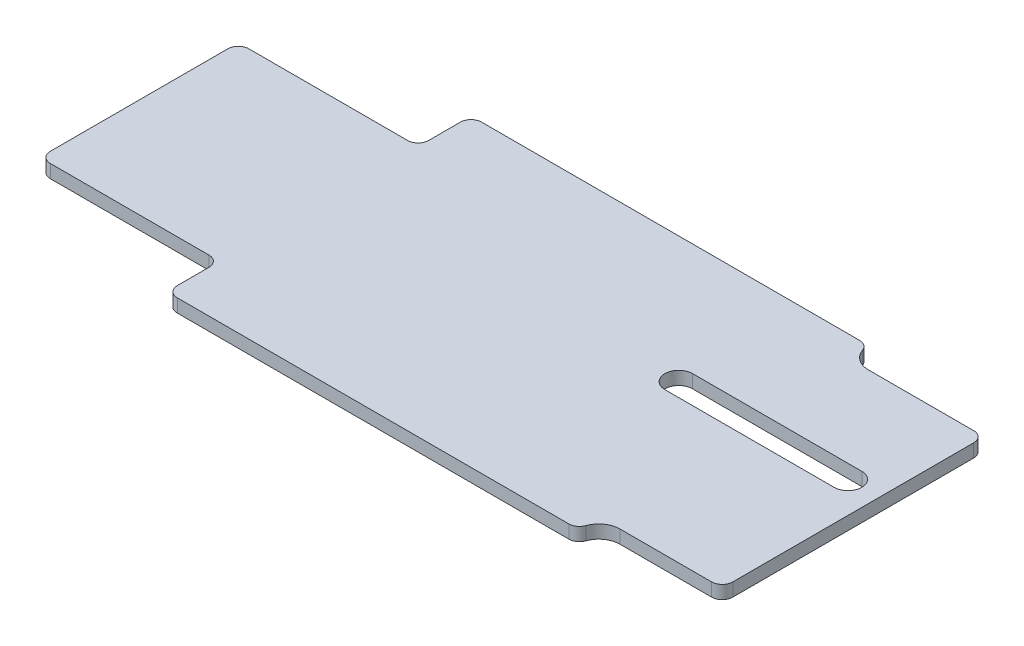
ISO-10303-21;
HEADER;
FILE_DESCRIPTION(('STEP AP214'),'2;1');
FILE_NAME('part.step','',(''),(''),'','','');
FILE_SCHEMA(('AUTOMOTIVE_DESIGN { 1 0 10303 214 1 1 1 1 }'));
ENDSEC;
DATA;
#1=APPLICATION_CONTEXT('core data for automotive mechanical design processes');
#2=APPLICATION_PROTOCOL_DEFINITION('international standard','automotive_design',2000,#1);
#3=PRODUCT_CONTEXT('',#1,'mechanical');
#4=PRODUCT('Part','Part','',(#3));
#5=PRODUCT_RELATED_PRODUCT_CATEGORY('part','',(#4));
#6=PRODUCT_DEFINITION_FORMATION('','',#4);
#7=PRODUCT_DEFINITION_CONTEXT('part definition',#1,'design');
#8=PRODUCT_DEFINITION('design','',#6,#7);
#9=PRODUCT_DEFINITION_SHAPE('','',#8);
#10=(LENGTH_UNIT() NAMED_UNIT(*) SI_UNIT(.MILLI.,.METRE.));
#11=(NAMED_UNIT(*) PLANE_ANGLE_UNIT() SI_UNIT($,.RADIAN.));
#12=(NAMED_UNIT(*) SI_UNIT($,.STERADIAN.) SOLID_ANGLE_UNIT());
#13=UNCERTAINTY_MEASURE_WITH_UNIT(LENGTH_MEASURE(1.E-05),#10,'distance_accuracy_value','');
#14=(GEOMETRIC_REPRESENTATION_CONTEXT(3) GLOBAL_UNCERTAINTY_ASSIGNED_CONTEXT((#13)) GLOBAL_UNIT_ASSIGNED_CONTEXT((#10,
#11,#12)) REPRESENTATION_CONTEXT('',''));
#15=CARTESIAN_POINT('',(0.,0.,0.));
#16=DIRECTION('',(0.,0.,1.));
#17=DIRECTION('',(1.,0.,0.));
#18=AXIS2_PLACEMENT_3D('',#15,#16,#17);
#19=CARTESIAN_POINT('',(48.8441541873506,3.175,-45.0981932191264));
#20=DIRECTION('',(0.,-1.,0.));
#21=DIRECTION('',(0.,0.,-1.));
#22=AXIS2_PLACEMENT_3D('',#19,#20,#21);
#23=PLANE('',#22);
#24=CARTESIAN_POINT('',(48.8441541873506,3.175,-45.0981932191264));
#25=DIRECTION('',(0.,1.,0.));
#26=DIRECTION('',(0.,0.,-1.));
#27=AXIS2_PLACEMENT_3D('',#24,#25,#26);
#28=CIRCLE('',#27,2.54);
#29=CARTESIAN_POINT('',(51.2388891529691,3.175,-45.9448598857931));
#30=VERTEX_POINT('',#29);
#31=CARTESIAN_POINT('',(48.8441541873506,3.175,-47.6381932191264));
#32=VERTEX_POINT('',#31);
#33=EDGE_CURVE('E274',#30,#32,#28,.T.);
#34=ORIENTED_EDGE('',*,*,#33,.T.);
#35=DIRECTION('',(-1.,0.,0.));
#36=VECTOR('',#35,1.);
#37=CARTESIAN_POINT('',(48.8441541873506,3.175,-47.6381932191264));
#38=LINE('',#37,#36);
#39=CARTESIAN_POINT('',(-41.9372130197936,3.175,-47.6381932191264));
#40=VERTEX_POINT('',#39);
#41=EDGE_CURVE('E278',#32,#40,#38,.T.);
#42=ORIENTED_EDGE('',*,*,#41,.T.);
#43=CARTESIAN_POINT('',(-41.9372130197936,3.175,-45.0981932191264));
#44=DIRECTION('',(0.,1.,0.));
#45=DIRECTION('',(0.,0.,1.));
#46=AXIS2_PLACEMENT_3D('',#43,#44,#45);
#47=CIRCLE('',#46,2.54);
#48=CARTESIAN_POINT('',(-44.4772130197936,3.175,-45.0981932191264));
#49=VERTEX_POINT('',#48);
#50=EDGE_CURVE('E282',#40,#49,#47,.T.);
#51=ORIENTED_EDGE('',*,*,#50,.T.);
#52=DIRECTION('',(0.,0.,1.));
#53=VECTOR('',#52,1.);
#54=CARTESIAN_POINT('',(-44.4772130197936,3.175,-45.0981932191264));
#55=LINE('',#54,#53);
#56=CARTESIAN_POINT('',(-44.4772130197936,3.175,-37.4781932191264));
#57=VERTEX_POINT('',#56);
#58=EDGE_CURVE('E285',#49,#57,#55,.T.);
#59=ORIENTED_EDGE('',*,*,#58,.T.);
#60=CARTESIAN_POINT('',(-47.0172130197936,3.175,-37.4781932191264));
#61=DIRECTION('',(0.,-1.,0.));
#62=DIRECTION('',(0.,0.,-1.));
#63=AXIS2_PLACEMENT_3D('',#60,#61,#62);
#64=CIRCLE('',#63,2.54);
#65=CARTESIAN_POINT('',(-47.0172130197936,3.175,-34.9381932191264));
#66=VERTEX_POINT('',#65);
#67=EDGE_CURVE('E288',#57,#66,#64,.T.);
#68=ORIENTED_EDGE('',*,*,#67,.T.);
#69=DIRECTION('',(-1.,0.,0.));
#70=VECTOR('',#69,1.);
#71=CARTESIAN_POINT('',(-47.0172130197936,3.175,-34.9381932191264));
#72=LINE('',#71,#70);
#73=CARTESIAN_POINT('',(-85.1172130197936,3.175,-34.9381932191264));
#74=VERTEX_POINT('',#73);
#75=EDGE_CURVE('E291',#66,#74,#72,.T.);
#76=ORIENTED_EDGE('',*,*,#75,.T.);
#77=CARTESIAN_POINT('',(-85.1172130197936,3.175,-32.3981932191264));
#78=DIRECTION('',(0.,1.,0.));
#79=DIRECTION('',(0.,0.,-1.));
#80=AXIS2_PLACEMENT_3D('',#77,#78,#79);
#81=CIRCLE('',#80,2.54000000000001);
#82=CARTESIAN_POINT('',(-87.6572130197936,3.175,-32.3981932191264));
#83=VERTEX_POINT('',#82);
#84=EDGE_CURVE('E294',#74,#83,#81,.T.);
#85=ORIENTED_EDGE('',*,*,#84,.T.);
#86=DIRECTION('',(0.,0.,1.));
#87=VECTOR('',#86,1.);
#88=CARTESIAN_POINT('',(-87.6572130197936,3.175,-32.3981932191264));
#89=LINE('',#88,#87);
#90=CARTESIAN_POINT('',(-87.6572130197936,3.175,10.2069868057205));
#91=VERTEX_POINT('',#90);
#92=EDGE_CURVE('E297',#83,#91,#89,.T.);
#93=ORIENTED_EDGE('',*,*,#92,.T.);
#94=CARTESIAN_POINT('',(-85.1172130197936,3.175,10.2069868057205));
#95=DIRECTION('',(0.,1.,0.));
#96=DIRECTION('',(0.,0.,1.));
#97=AXIS2_PLACEMENT_3D('',#94,#95,#96);
#98=CIRCLE('',#97,2.54000000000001);
#99=CARTESIAN_POINT('',(-85.1172130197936,3.175,12.7469868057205));
#100=VERTEX_POINT('',#99);
#101=EDGE_CURVE('E300',#91,#100,#98,.T.);
#102=ORIENTED_EDGE('',*,*,#101,.T.);
#103=DIRECTION('',(1.,0.,0.));
#104=VECTOR('',#103,1.);
#105=CARTESIAN_POINT('',(-85.1172130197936,3.175,12.7469868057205));
#106=LINE('',#105,#104);
#107=CARTESIAN_POINT('',(-47.0172130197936,3.175,12.7469868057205));
#108=VERTEX_POINT('',#107);
#109=EDGE_CURVE('E303',#100,#108,#106,.T.);
#110=ORIENTED_EDGE('',*,*,#109,.T.);
#111=CARTESIAN_POINT('',(-47.0172130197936,3.175,15.2869868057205));
#112=DIRECTION('',(0.,-1.,0.));
#113=DIRECTION('',(0.,0.,-1.));
#114=AXIS2_PLACEMENT_3D('',#111,#112,#113);
#115=CIRCLE('',#114,2.54);
#116=CARTESIAN_POINT('',(-44.4772130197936,3.175,15.2869868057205));
#117=VERTEX_POINT('',#116);
#118=EDGE_CURVE('E306',#108,#117,#115,.T.);
#119=ORIENTED_EDGE('',*,*,#118,.T.);
#120=DIRECTION('',(0.,0.,1.));
#121=VECTOR('',#120,1.);
#122=CARTESIAN_POINT('',(-44.4772130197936,3.175,15.2869868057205));
#123=LINE('',#122,#121);
#124=CARTESIAN_POINT('',(-44.4772130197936,3.175,22.9069868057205));
#125=VERTEX_POINT('',#124);
#126=EDGE_CURVE('E309',#117,#125,#123,.T.);
#127=ORIENTED_EDGE('',*,*,#126,.T.);
#128=CARTESIAN_POINT('',(-41.9372130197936,3.175,22.9069868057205));
#129=DIRECTION('',(0.,1.,0.));
#130=DIRECTION('',(0.,0.,1.));
#131=AXIS2_PLACEMENT_3D('',#128,#129,#130);
#132=CIRCLE('',#131,2.54);
#133=CARTESIAN_POINT('',(-41.9372130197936,3.175,25.4469868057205));
#134=VERTEX_POINT('',#133);
#135=EDGE_CURVE('E312',#125,#134,#132,.T.);
#136=ORIENTED_EDGE('',*,*,#135,.T.);
#137=DIRECTION('',(1.,0.,0.));
#138=VECTOR('',#137,1.);
#139=CARTESIAN_POINT('',(-41.9372130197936,3.175,25.4469868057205));
#140=LINE('',#139,#138);
#141=CARTESIAN_POINT('',(52.1093002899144,3.175,25.4469868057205));
#142=VERTEX_POINT('',#141);
#143=EDGE_CURVE('E315',#134,#142,#140,.T.);
#144=ORIENTED_EDGE('',*,*,#143,.T.);
#145=CARTESIAN_POINT('',(52.1093002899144,3.175,22.9069868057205));
#146=DIRECTION('',(0.,1.,0.));
#147=DIRECTION('',(0.,0.,1.));
#148=AXIS2_PLACEMENT_3D('',#145,#146,#147);
#149=CIRCLE('',#148,2.54);
#150=CARTESIAN_POINT('',(54.5040352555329,3.175,23.7536534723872));
#151=VERTEX_POINT('',#150);
#152=EDGE_CURVE('E318',#142,#151,#149,.T.);
#153=ORIENTED_EDGE('',*,*,#152,.T.);
#154=CARTESIAN_POINT('',(59.2935051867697,3.175,25.4469868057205));
#155=DIRECTION('',(0.,-1.,0.));
#156=DIRECTION('',(0.,0.,-1.));
#157=AXIS2_PLACEMENT_3D('',#154,#155,#156);
#158=CIRCLE('',#157,5.07999999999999);
#159=CARTESIAN_POINT('',(59.2935051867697,3.175,20.3669868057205));
#160=VERTEX_POINT('',#159);
#161=EDGE_CURVE('E321',#151,#160,#158,.T.);
#162=ORIENTED_EDGE('',*,*,#161,.T.);
#163=DIRECTION('',(1.,0.,0.));
#164=VECTOR('',#163,1.);
#165=CARTESIAN_POINT('',(81.3144949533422,3.175,20.3669868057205));
#166=LINE('',#165,#164);
#167=CARTESIAN_POINT('',(81.3144949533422,3.175,20.3669868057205));
#168=VERTEX_POINT('',#167);
#169=EDGE_CURVE('E324',#160,#168,#166,.T.);
#170=ORIENTED_EDGE('',*,*,#169,.T.);
#171=CARTESIAN_POINT('',(81.3144949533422,3.175,17.8269868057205));
#172=DIRECTION('',(0.,1.,0.));
#173=DIRECTION('',(0.,0.,-1.));
#174=AXIS2_PLACEMENT_3D('',#171,#172,#173);
#175=CIRCLE('',#174,2.54);
#176=CARTESIAN_POINT('',(83.8544949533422,3.175,17.8269868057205));
#177=VERTEX_POINT('',#176);
#178=EDGE_CURVE('E327',#168,#177,#175,.T.);
#179=ORIENTED_EDGE('',*,*,#178,.T.);
#180=DIRECTION('',(0.,0.,-1.));
#181=VECTOR('',#180,1.);
#182=CARTESIAN_POINT('',(83.8544949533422,3.175,-40.0181932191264));
#183=LINE('',#182,#181);
#184=CARTESIAN_POINT('',(83.8544949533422,3.175,-40.0181932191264));
#185=VERTEX_POINT('',#184);
#186=EDGE_CURVE('E330',#177,#185,#183,.T.);
#187=ORIENTED_EDGE('',*,*,#186,.T.);
#188=CARTESIAN_POINT('',(81.3144949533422,3.175,-40.0181932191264));
#189=DIRECTION('',(0.,1.,0.));
#190=DIRECTION('',(0.,0.,-1.));
#191=AXIS2_PLACEMENT_3D('',#188,#189,#190);
#192=CIRCLE('',#191,2.54);
#193=CARTESIAN_POINT('',(81.3144949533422,3.175,-42.5581932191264));
#194=VERTEX_POINT('',#193);
#195=EDGE_CURVE('E333',#185,#194,#192,.T.);
#196=ORIENTED_EDGE('',*,*,#195,.T.);
#197=DIRECTION('',(-1.,0.,0.));
#198=VECTOR('',#197,1.);
#199=CARTESIAN_POINT('',(56.0283590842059,3.175,-42.5581932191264));
#200=LINE('',#199,#198);
#201=CARTESIAN_POINT('',(56.0283590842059,3.175,-42.5581932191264));
#202=VERTEX_POINT('',#201);
#203=EDGE_CURVE('E336',#194,#202,#200,.T.);
#204=ORIENTED_EDGE('',*,*,#203,.T.);
#205=CARTESIAN_POINT('',(56.0283590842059,3.175,-47.6381932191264));
#206=DIRECTION('',(0.,-1.,0.));
#207=DIRECTION('',(0.,0.,1.));
#208=AXIS2_PLACEMENT_3D('',#205,#206,#207);
#209=CIRCLE('',#208,5.08);
#210=EDGE_CURVE('E339',#202,#30,#209,.T.);
#211=ORIENTED_EDGE('',*,*,#210,.T.);
#212=EDGE_LOOP('',(#34,#42,#51,#59,#68,#76,#85,#93,#102,#110,#119,#127,#136,#144,#153,#162,#170,
#179,#187,#196,#204,#211));
#213=FACE_BOUND('',#212,.T.);
#214=CARTESIAN_POINT('',(35.7083590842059,3.175,-17.3386988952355));
#215=DIRECTION('',(0.,1.,0.));
#216=DIRECTION('',(0.,0.,1.));
#217=AXIS2_PLACEMENT_3D('',#214,#215,#216);
#218=CIRCLE('',#217,3.33173955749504);
#219=CARTESIAN_POINT('',(35.7083590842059,3.175,-20.6704384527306));
#220=VERTEX_POINT('',#219);
#221=CARTESIAN_POINT('',(35.7083590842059,3.175,-14.0069593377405));
#222=VERTEX_POINT('',#221);
#223=EDGE_CURVE('E225',#220,#222,#218,.T.);
#224=ORIENTED_EDGE('',*,*,#223,.F.);
#225=DIRECTION('',(-1.,0.,0.));
#226=VECTOR('',#225,1.);
#227=CARTESIAN_POINT('',(35.7083590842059,3.175,-20.6704384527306));
#228=LINE('',#227,#226);
#229=CARTESIAN_POINT('',(76.3483590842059,3.175,-20.6704384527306));
#230=VERTEX_POINT('',#229);
#231=EDGE_CURVE('E252',#230,#220,#228,.T.);
#232=ORIENTED_EDGE('',*,*,#231,.F.);
#233=CARTESIAN_POINT('',(76.3483590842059,3.175,-17.3386988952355));
#234=DIRECTION('',(0.,1.,0.));
#235=DIRECTION('',(0.,0.,1.));
#236=AXIS2_PLACEMENT_3D('',#233,#234,#235);
#237=CIRCLE('',#236,3.33173955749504);
#238=CARTESIAN_POINT('',(76.3483590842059,3.175,-14.0069593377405));
#239=VERTEX_POINT('',#238);
#240=EDGE_CURVE('E247',#239,#230,#237,.T.);
#241=ORIENTED_EDGE('',*,*,#240,.F.);
#242=DIRECTION('',(1.,0.,0.));
#243=VECTOR('',#242,1.);
#244=CARTESIAN_POINT('',(35.7083590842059,3.175,-14.0069593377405));
#245=LINE('',#244,#243);
#246=EDGE_CURVE('E234',#222,#239,#245,.T.);
#247=ORIENTED_EDGE('',*,*,#246,.F.);
#248=EDGE_LOOP('',(#224,#232,#241,#247));
#249=FACE_BOUND('',#248,.T.);
#250=ADVANCED_FACE('F51',(#213,#249),#23,.F.);
#251=CARTESIAN_POINT('',(48.8441541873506,0.,-45.0981932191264));
#252=DIRECTION('',(0.,-1.,0.));
#253=DIRECTION('',(0.,0.,-1.));
#254=AXIS2_PLACEMENT_3D('',#251,#252,#253);
#255=PLANE('',#254);
#256=CARTESIAN_POINT('',(48.8441541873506,0.,-45.0981932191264));
#257=DIRECTION('',(0.,1.,0.));
#258=DIRECTION('',(0.,0.,-1.));
#259=AXIS2_PLACEMENT_3D('',#256,#257,#258);
#260=CIRCLE('',#259,2.54);
#261=CARTESIAN_POINT('',(51.2388891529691,0.,-45.9448598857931));
#262=VERTEX_POINT('',#261);
#263=CARTESIAN_POINT('',(48.8441541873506,0.,-47.6381932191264));
#264=VERTEX_POINT('',#263);
#265=EDGE_CURVE('E243',#262,#264,#260,.T.);
#266=ORIENTED_EDGE('',*,*,#265,.F.);
#267=CARTESIAN_POINT('',(56.0283590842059,0.,-47.6381932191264));
#268=DIRECTION('',(0.,-1.,0.));
#269=DIRECTION('',(0.,0.,1.));
#270=AXIS2_PLACEMENT_3D('',#267,#268,#269);
#271=CIRCLE('',#270,5.08);
#272=CARTESIAN_POINT('',(56.0283590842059,0.,-42.5581932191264));
#273=VERTEX_POINT('',#272);
#274=EDGE_CURVE('E279',#273,#262,#271,.T.);
#275=ORIENTED_EDGE('',*,*,#274,.F.);
#276=DIRECTION('',(-1.,0.,0.));
#277=VECTOR('',#276,1.);
#278=CARTESIAN_POINT('',(56.0283590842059,0.,-42.5581932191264));
#279=LINE('',#278,#277);
#280=CARTESIAN_POINT('',(81.3144949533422,0.,-42.5581932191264));
#281=VERTEX_POINT('',#280);
#282=EDGE_CURVE('E403',#281,#273,#279,.T.);
#283=ORIENTED_EDGE('',*,*,#282,.F.);
#284=CARTESIAN_POINT('',(81.3144949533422,0.,-40.0181932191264));
#285=DIRECTION('',(0.,1.,0.));
#286=DIRECTION('',(0.,0.,-1.));
#287=AXIS2_PLACEMENT_3D('',#284,#285,#286);
#288=CIRCLE('',#287,2.54);
#289=CARTESIAN_POINT('',(83.8544949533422,0.,-40.0181932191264));
#290=VERTEX_POINT('',#289);
#291=EDGE_CURVE('E400',#290,#281,#288,.T.);
#292=ORIENTED_EDGE('',*,*,#291,.F.);
#293=DIRECTION('',(0.,0.,-1.));
#294=VECTOR('',#293,1.);
#295=CARTESIAN_POINT('',(83.8544949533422,0.,-40.0181932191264));
#296=LINE('',#295,#294);
#297=CARTESIAN_POINT('',(83.8544949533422,0.,17.8269868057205));
#298=VERTEX_POINT('',#297);
#299=EDGE_CURVE('E397',#298,#290,#296,.T.);
#300=ORIENTED_EDGE('',*,*,#299,.F.);
#301=CARTESIAN_POINT('',(81.3144949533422,0.,17.8269868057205));
#302=DIRECTION('',(0.,1.,0.));
#303=DIRECTION('',(0.,0.,-1.));
#304=AXIS2_PLACEMENT_3D('',#301,#302,#303);
#305=CIRCLE('',#304,2.54);
#306=CARTESIAN_POINT('',(81.3144949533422,0.,20.3669868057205));
#307=VERTEX_POINT('',#306);
#308=EDGE_CURVE('E394',#307,#298,#305,.T.);
#309=ORIENTED_EDGE('',*,*,#308,.F.);
#310=DIRECTION('',(1.,0.,0.));
#311=VECTOR('',#310,1.);
#312=CARTESIAN_POINT('',(81.3144949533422,0.,20.3669868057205));
#313=LINE('',#312,#311);
#314=CARTESIAN_POINT('',(59.2935051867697,0.,20.3669868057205));
#315=VERTEX_POINT('',#314);
#316=EDGE_CURVE('E391',#315,#307,#313,.T.);
#317=ORIENTED_EDGE('',*,*,#316,.F.);
#318=CARTESIAN_POINT('',(59.2935051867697,0.,25.4469868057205));
#319=DIRECTION('',(0.,-1.,0.));
#320=DIRECTION('',(0.,0.,-1.));
#321=AXIS2_PLACEMENT_3D('',#318,#319,#320);
#322=CIRCLE('',#321,5.07999999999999);
#323=CARTESIAN_POINT('',(54.5040352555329,0.,23.7536534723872));
#324=VERTEX_POINT('',#323);
#325=EDGE_CURVE('E388',#324,#315,#322,.T.);
#326=ORIENTED_EDGE('',*,*,#325,.F.);
#327=CARTESIAN_POINT('',(52.1093002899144,0.,22.9069868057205));
#328=DIRECTION('',(0.,1.,0.));
#329=DIRECTION('',(0.,0.,1.));
#330=AXIS2_PLACEMENT_3D('',#327,#328,#329);
#331=CIRCLE('',#330,2.54);
#332=CARTESIAN_POINT('',(52.1093002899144,0.,25.4469868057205));
#333=VERTEX_POINT('',#332);
#334=EDGE_CURVE('E385',#333,#324,#331,.T.);
#335=ORIENTED_EDGE('',*,*,#334,.F.);
#336=DIRECTION('',(1.,0.,0.));
#337=VECTOR('',#336,1.);
#338=CARTESIAN_POINT('',(-41.9372130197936,0.,25.4469868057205));
#339=LINE('',#338,#337);
#340=CARTESIAN_POINT('',(-41.9372130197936,0.,25.4469868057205));
#341=VERTEX_POINT('',#340);
#342=EDGE_CURVE('E382',#341,#333,#339,.T.);
#343=ORIENTED_EDGE('',*,*,#342,.F.);
#344=CARTESIAN_POINT('',(-41.9372130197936,0.,22.9069868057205));
#345=DIRECTION('',(0.,1.,0.));
#346=DIRECTION('',(0.,0.,1.));
#347=AXIS2_PLACEMENT_3D('',#344,#345,#346);
#348=CIRCLE('',#347,2.54);
#349=CARTESIAN_POINT('',(-44.4772130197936,0.,22.9069868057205));
#350=VERTEX_POINT('',#349);
#351=EDGE_CURVE('E379',#350,#341,#348,.T.);
#352=ORIENTED_EDGE('',*,*,#351,.F.);
#353=DIRECTION('',(0.,0.,1.));
#354=VECTOR('',#353,1.);
#355=CARTESIAN_POINT('',(-44.4772130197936,0.,15.2869868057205));
#356=LINE('',#355,#354);
#357=CARTESIAN_POINT('',(-44.4772130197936,0.,15.2869868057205));
#358=VERTEX_POINT('',#357);
#359=EDGE_CURVE('E376',#358,#350,#356,.T.);
#360=ORIENTED_EDGE('',*,*,#359,.F.);
#361=CARTESIAN_POINT('',(-47.0172130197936,0.,15.2869868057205));
#362=DIRECTION('',(0.,-1.,0.));
#363=DIRECTION('',(0.,0.,-1.));
#364=AXIS2_PLACEMENT_3D('',#361,#362,#363);
#365=CIRCLE('',#364,2.54);
#366=CARTESIAN_POINT('',(-47.0172130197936,0.,12.7469868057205));
#367=VERTEX_POINT('',#366);
#368=EDGE_CURVE('E373',#367,#358,#365,.T.);
#369=ORIENTED_EDGE('',*,*,#368,.F.);
#370=DIRECTION('',(1.,0.,0.));
#371=VECTOR('',#370,1.);
#372=CARTESIAN_POINT('',(-85.1172130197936,0.,12.7469868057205));
#373=LINE('',#372,#371);
#374=CARTESIAN_POINT('',(-85.1172130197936,0.,12.7469868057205));
#375=VERTEX_POINT('',#374);
#376=EDGE_CURVE('E370',#375,#367,#373,.T.);
#377=ORIENTED_EDGE('',*,*,#376,.F.);
#378=CARTESIAN_POINT('',(-85.1172130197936,0.,10.2069868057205));
#379=DIRECTION('',(0.,1.,0.));
#380=DIRECTION('',(0.,0.,1.));
#381=AXIS2_PLACEMENT_3D('',#378,#379,#380);
#382=CIRCLE('',#381,2.54000000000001);
#383=CARTESIAN_POINT('',(-87.6572130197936,0.,10.2069868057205));
#384=VERTEX_POINT('',#383);
#385=EDGE_CURVE('E367',#384,#375,#382,.T.);
#386=ORIENTED_EDGE('',*,*,#385,.F.);
#387=DIRECTION('',(0.,0.,1.));
#388=VECTOR('',#387,1.);
#389=CARTESIAN_POINT('',(-87.6572130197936,0.,-32.3981932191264));
#390=LINE('',#389,#388);
#391=CARTESIAN_POINT('',(-87.6572130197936,0.,-32.3981932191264));
#392=VERTEX_POINT('',#391);
#393=EDGE_CURVE('E364',#392,#384,#390,.T.);
#394=ORIENTED_EDGE('',*,*,#393,.F.);
#395=CARTESIAN_POINT('',(-85.1172130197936,0.,-32.3981932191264));
#396=DIRECTION('',(0.,1.,0.));
#397=DIRECTION('',(0.,0.,-1.));
#398=AXIS2_PLACEMENT_3D('',#395,#396,#397);
#399=CIRCLE('',#398,2.54000000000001);
#400=CARTESIAN_POINT('',(-85.1172130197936,0.,-34.9381932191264));
#401=VERTEX_POINT('',#400);
#402=EDGE_CURVE('E361',#401,#392,#399,.T.);
#403=ORIENTED_EDGE('',*,*,#402,.F.);
#404=DIRECTION('',(-1.,0.,0.));
#405=VECTOR('',#404,1.);
#406=CARTESIAN_POINT('',(-47.0172130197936,0.,-34.9381932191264));
#407=LINE('',#406,#405);
#408=CARTESIAN_POINT('',(-47.0172130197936,0.,-34.9381932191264));
#409=VERTEX_POINT('',#408);
#410=EDGE_CURVE('E358',#409,#401,#407,.T.);
#411=ORIENTED_EDGE('',*,*,#410,.F.);
#412=CARTESIAN_POINT('',(-47.0172130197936,0.,-37.4781932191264));
#413=DIRECTION('',(0.,-1.,0.));
#414=DIRECTION('',(0.,0.,-1.));
#415=AXIS2_PLACEMENT_3D('',#412,#413,#414);
#416=CIRCLE('',#415,2.54);
#417=CARTESIAN_POINT('',(-44.4772130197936,0.,-37.4781932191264));
#418=VERTEX_POINT('',#417);
#419=EDGE_CURVE('E355',#418,#409,#416,.T.);
#420=ORIENTED_EDGE('',*,*,#419,.F.);
#421=DIRECTION('',(0.,0.,1.));
#422=VECTOR('',#421,1.);
#423=CARTESIAN_POINT('',(-44.4772130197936,0.,-45.0981932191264));
#424=LINE('',#423,#422);
#425=CARTESIAN_POINT('',(-44.4772130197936,0.,-45.0981932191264));
#426=VERTEX_POINT('',#425);
#427=EDGE_CURVE('E352',#426,#418,#424,.T.);
#428=ORIENTED_EDGE('',*,*,#427,.F.);
#429=CARTESIAN_POINT('',(-41.9372130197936,0.,-45.0981932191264));
#430=DIRECTION('',(0.,1.,0.));
#431=DIRECTION('',(0.,0.,1.));
#432=AXIS2_PLACEMENT_3D('',#429,#430,#431);
#433=CIRCLE('',#432,2.54);
#434=CARTESIAN_POINT('',(-41.9372130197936,0.,-47.6381932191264));
#435=VERTEX_POINT('',#434);
#436=EDGE_CURVE('E349',#435,#426,#433,.T.);
#437=ORIENTED_EDGE('',*,*,#436,.F.);
#438=DIRECTION('',(-1.,0.,0.));
#439=VECTOR('',#438,1.);
#440=CARTESIAN_POINT('',(48.8441541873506,0.,-47.6381932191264));
#441=LINE('',#440,#439);
#442=EDGE_CURVE('E346',#264,#435,#441,.T.);
#443=ORIENTED_EDGE('',*,*,#442,.F.);
#444=EDGE_LOOP('',(#266,#275,#283,#292,#300,#309,#317,#326,#335,#343,#352,#360,#369,#377,#386,
#394,#403,#411,#420,#428,#437,#443));
#445=FACE_BOUND('',#444,.T.);
#446=DIRECTION('',(-1.,0.,0.));
#447=VECTOR('',#446,1.);
#448=CARTESIAN_POINT('',(35.7083590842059,0.,-20.6704384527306));
#449=LINE('',#448,#447);
#450=CARTESIAN_POINT('',(76.3483590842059,0.,-20.6704384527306));
#451=VERTEX_POINT('',#450);
#452=CARTESIAN_POINT('',(35.7083590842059,0.,-20.6704384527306));
#453=VERTEX_POINT('',#452);
#454=EDGE_CURVE('E235',#451,#453,#449,.T.);
#455=ORIENTED_EDGE('',*,*,#454,.T.);
#456=CARTESIAN_POINT('',(35.7083590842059,0.,-17.3386988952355));
#457=DIRECTION('',(0.,1.,0.));
#458=DIRECTION('',(0.,0.,1.));
#459=AXIS2_PLACEMENT_3D('',#456,#457,#458);
#460=CIRCLE('',#459,3.33173955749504);
#461=CARTESIAN_POINT('',(35.7083590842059,0.,-14.0069593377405));
#462=VERTEX_POINT('',#461);
#463=EDGE_CURVE('E75',#453,#462,#460,.T.);
#464=ORIENTED_EDGE('',*,*,#463,.T.);
#465=DIRECTION('',(1.,0.,0.));
#466=VECTOR('',#465,1.);
#467=CARTESIAN_POINT('',(35.7083590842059,0.,-14.0069593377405));
#468=LINE('',#467,#466);
#469=CARTESIAN_POINT('',(76.3483590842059,0.,-14.0069593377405));
#470=VERTEX_POINT('',#469);
#471=EDGE_CURVE('E241',#462,#470,#468,.T.);
#472=ORIENTED_EDGE('',*,*,#471,.T.);
#473=CARTESIAN_POINT('',(76.3483590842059,0.,-17.3386988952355));
#474=DIRECTION('',(0.,1.,0.));
#475=DIRECTION('',(0.,0.,1.));
#476=AXIS2_PLACEMENT_3D('',#473,#474,#475);
#477=CIRCLE('',#476,3.33173955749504);
#478=EDGE_CURVE('E261',#470,#451,#477,.T.);
#479=ORIENTED_EDGE('',*,*,#478,.T.);
#480=EDGE_LOOP('',(#455,#464,#472,#479));
#481=FACE_BOUND('',#480,.T.);
#482=ADVANCED_FACE('F499',(#445,#481),#255,.T.);
#483=CARTESIAN_POINT('',(48.8441541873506,3.175,-45.0981932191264));
#484=DIRECTION('',(0.,-1.,0.));
#485=DIRECTION('',(0.,0.,-1.));
#486=AXIS2_PLACEMENT_3D('',#483,#484,#485);
#487=CYLINDRICAL_SURFACE('',#486,2.54);
#488=ORIENTED_EDGE('',*,*,#265,.T.);
#489=DIRECTION('',(0.,-1.,0.));
#490=VECTOR('',#489,1.);
#491=CARTESIAN_POINT('',(48.8441541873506,3.175,-47.6381932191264));
#492=LINE('',#491,#490);
#493=EDGE_CURVE('E11',#32,#264,#492,.T.);
#494=ORIENTED_EDGE('',*,*,#493,.F.);
#495=ORIENTED_EDGE('',*,*,#33,.F.);
#496=DIRECTION('',(0.,-1.,0.));
#497=VECTOR('',#496,1.);
#498=CARTESIAN_POINT('',(51.2388891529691,3.175,-45.9448598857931));
#499=LINE('',#498,#497);
#500=EDGE_CURVE('E342',#30,#262,#499,.T.);
#501=ORIENTED_EDGE('',*,*,#500,.T.);
#502=EDGE_LOOP('',(#488,#494,#495,#501));
#503=FACE_BOUND('',#502,.T.);
#504=ADVANCED_FACE('F53',(#503),#487,.T.);
#505=CARTESIAN_POINT('',(48.8441541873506,3.175,-47.6381932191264));
#506=DIRECTION('',(0.,0.,1.));
#507=DIRECTION('',(1.,0.,0.));
#508=AXIS2_PLACEMENT_3D('',#505,#506,#507);
#509=PLANE('',#508);
#510=ORIENTED_EDGE('',*,*,#442,.T.);
#511=DIRECTION('',(0.,-1.,0.));
#512=VECTOR('',#511,1.);
#513=CARTESIAN_POINT('',(-41.9372130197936,3.175,-47.6381932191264));
#514=LINE('',#513,#512);
#515=EDGE_CURVE('E60',#40,#435,#514,.T.);
#516=ORIENTED_EDGE('',*,*,#515,.F.);
#517=ORIENTED_EDGE('',*,*,#41,.F.);
#518=ORIENTED_EDGE('',*,*,#493,.T.);
#519=EDGE_LOOP('',(#510,#516,#517,#518));
#520=FACE_BOUND('',#519,.T.);
#521=ADVANCED_FACE('F516',(#520),#509,.F.);
#522=CARTESIAN_POINT('',(-41.9372130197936,3.175,-45.0981932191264));
#523=DIRECTION('',(0.,-1.,0.));
#524=DIRECTION('',(0.,0.,-1.));
#525=AXIS2_PLACEMENT_3D('',#522,#523,#524);
#526=CYLINDRICAL_SURFACE('',#525,2.54);
#527=ORIENTED_EDGE('',*,*,#436,.T.);
#528=DIRECTION('',(0.,-1.,0.));
#529=VECTOR('',#528,1.);
#530=CARTESIAN_POINT('',(-44.4772130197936,3.175,-45.0981932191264));
#531=LINE('',#530,#529);
#532=EDGE_CURVE('E483',#49,#426,#531,.T.);
#533=ORIENTED_EDGE('',*,*,#532,.F.);
#534=ORIENTED_EDGE('',*,*,#50,.F.);
#535=ORIENTED_EDGE('',*,*,#515,.T.);
#536=EDGE_LOOP('',(#527,#533,#534,#535));
#537=FACE_BOUND('',#536,.T.);
#538=ADVANCED_FACE('F493',(#537),#526,.T.);
#539=CARTESIAN_POINT('',(-44.4772130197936,3.175,-45.0981932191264));
#540=DIRECTION('',(1.,0.,0.));
#541=DIRECTION('',(0.,0.,-1.));
#542=AXIS2_PLACEMENT_3D('',#539,#540,#541);
#543=PLANE('',#542);
#544=ORIENTED_EDGE('',*,*,#427,.T.);
#545=DIRECTION('',(0.,-1.,0.));
#546=VECTOR('',#545,1.);
#547=CARTESIAN_POINT('',(-44.4772130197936,3.175,-37.4781932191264));
#548=LINE('',#547,#546);
#549=EDGE_CURVE('E479',#57,#418,#548,.T.);
#550=ORIENTED_EDGE('',*,*,#549,.F.);
#551=ORIENTED_EDGE('',*,*,#58,.F.);
#552=ORIENTED_EDGE('',*,*,#532,.T.);
#553=EDGE_LOOP('',(#544,#550,#551,#552));
#554=FACE_BOUND('',#553,.T.);
#555=ADVANCED_FACE('F505',(#554),#543,.F.);
#556=CARTESIAN_POINT('',(-47.0172130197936,3.175,-37.4781932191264));
#557=DIRECTION('',(0.,-1.,0.));
#558=DIRECTION('',(0.,0.,-1.));
#559=AXIS2_PLACEMENT_3D('',#556,#557,#558);
#560=CYLINDRICAL_SURFACE('',#559,2.54);
#561=ORIENTED_EDGE('',*,*,#419,.T.);
#562=DIRECTION('',(0.,-1.,0.));
#563=VECTOR('',#562,1.);
#564=CARTESIAN_POINT('',(-47.0172130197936,3.175,-34.9381932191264));
#565=LINE('',#564,#563);
#566=EDGE_CURVE('E475',#66,#409,#565,.T.);
#567=ORIENTED_EDGE('',*,*,#566,.F.);
#568=ORIENTED_EDGE('',*,*,#67,.F.);
#569=ORIENTED_EDGE('',*,*,#549,.T.);
#570=EDGE_LOOP('',(#561,#567,#568,#569));
#571=FACE_BOUND('',#570,.T.);
#572=ADVANCED_FACE('F509',(#571),#560,.F.);
#573=CARTESIAN_POINT('',(-47.0172130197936,3.175,-34.9381932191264));
#574=DIRECTION('',(0.,0.,1.));
#575=DIRECTION('',(1.,0.,0.));
#576=AXIS2_PLACEMENT_3D('',#573,#574,#575);
#577=PLANE('',#576);
#578=ORIENTED_EDGE('',*,*,#410,.T.);
#579=DIRECTION('',(0.,-1.,0.));
#580=VECTOR('',#579,1.);
#581=CARTESIAN_POINT('',(-85.1172130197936,3.175,-34.9381932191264));
#582=LINE('',#581,#580);
#583=EDGE_CURVE('E471',#74,#401,#582,.T.);
#584=ORIENTED_EDGE('',*,*,#583,.F.);
#585=ORIENTED_EDGE('',*,*,#75,.F.);
#586=ORIENTED_EDGE('',*,*,#566,.T.);
#587=EDGE_LOOP('',(#578,#584,#585,#586));
#588=FACE_BOUND('',#587,.T.);
#589=ADVANCED_FACE('F599',(#588),#577,.F.);
#590=CARTESIAN_POINT('',(-85.1172130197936,3.175,-32.3981932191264));
#591=DIRECTION('',(0.,-1.,0.));
#592=DIRECTION('',(0.,0.,-1.));
#593=AXIS2_PLACEMENT_3D('',#590,#591,#592);
#594=CYLINDRICAL_SURFACE('',#593,2.54000000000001);
#595=ORIENTED_EDGE('',*,*,#402,.T.);
#596=DIRECTION('',(0.,-1.,0.));
#597=VECTOR('',#596,1.);
#598=CARTESIAN_POINT('',(-87.6572130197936,3.175,-32.3981932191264));
#599=LINE('',#598,#597);
#600=EDGE_CURVE('E467',#83,#392,#599,.T.);
#601=ORIENTED_EDGE('',*,*,#600,.F.);
#602=ORIENTED_EDGE('',*,*,#84,.F.);
#603=ORIENTED_EDGE('',*,*,#583,.T.);
#604=EDGE_LOOP('',(#595,#601,#602,#603));
#605=FACE_BOUND('',#604,.T.);
#606=ADVANCED_FACE('F596',(#605),#594,.T.);
#607=CARTESIAN_POINT('',(-87.6572130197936,3.175,-32.3981932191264));
#608=DIRECTION('',(1.,0.,0.));
#609=DIRECTION('',(0.,0.,-1.));
#610=AXIS2_PLACEMENT_3D('',#607,#608,#609);
#611=PLANE('',#610);
#612=ORIENTED_EDGE('',*,*,#393,.T.);
#613=DIRECTION('',(0.,-1.,0.));
#614=VECTOR('',#613,1.);
#615=CARTESIAN_POINT('',(-87.6572130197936,3.175,10.2069868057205));
#616=LINE('',#615,#614);
#617=EDGE_CURVE('E463',#91,#384,#616,.T.);
#618=ORIENTED_EDGE('',*,*,#617,.F.);
#619=ORIENTED_EDGE('',*,*,#92,.F.);
#620=ORIENTED_EDGE('',*,*,#600,.T.);
#621=EDGE_LOOP('',(#612,#618,#619,#620));
#622=FACE_BOUND('',#621,.T.);
#623=ADVANCED_FACE('F592',(#622),#611,.F.);
#624=CARTESIAN_POINT('',(-85.1172130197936,3.175,10.2069868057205));
#625=DIRECTION('',(0.,-1.,0.));
#626=DIRECTION('',(0.,0.,-1.));
#627=AXIS2_PLACEMENT_3D('',#624,#625,#626);
#628=CYLINDRICAL_SURFACE('',#627,2.54000000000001);
#629=ORIENTED_EDGE('',*,*,#385,.T.);
#630=DIRECTION('',(0.,-1.,0.));
#631=VECTOR('',#630,1.);
#632=CARTESIAN_POINT('',(-85.1172130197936,3.175,12.7469868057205));
#633=LINE('',#632,#631);
#634=EDGE_CURVE('E459',#100,#375,#633,.T.);
#635=ORIENTED_EDGE('',*,*,#634,.F.);
#636=ORIENTED_EDGE('',*,*,#101,.F.);
#637=ORIENTED_EDGE('',*,*,#617,.T.);
#638=EDGE_LOOP('',(#629,#635,#636,#637));
#639=FACE_BOUND('',#638,.T.);
#640=ADVANCED_FACE('F588',(#639),#628,.T.);
#641=CARTESIAN_POINT('',(-85.1172130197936,3.175,12.7469868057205));
#642=DIRECTION('',(0.,0.,-1.));
#643=DIRECTION('',(-1.,0.,0.));
#644=AXIS2_PLACEMENT_3D('',#641,#642,#643);
#645=PLANE('',#644);
#646=ORIENTED_EDGE('',*,*,#376,.T.);
#647=DIRECTION('',(0.,-1.,0.));
#648=VECTOR('',#647,1.);
#649=CARTESIAN_POINT('',(-47.0172130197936,3.175,12.7469868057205));
#650=LINE('',#649,#648);
#651=EDGE_CURVE('E455',#108,#367,#650,.T.);
#652=ORIENTED_EDGE('',*,*,#651,.F.);
#653=ORIENTED_EDGE('',*,*,#109,.F.);
#654=ORIENTED_EDGE('',*,*,#634,.T.);
#655=EDGE_LOOP('',(#646,#652,#653,#654));
#656=FACE_BOUND('',#655,.T.);
#657=ADVANCED_FACE('F583',(#656),#645,.F.);
#658=CARTESIAN_POINT('',(-47.0172130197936,3.175,15.2869868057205));
#659=DIRECTION('',(0.,-1.,0.));
#660=DIRECTION('',(0.,0.,-1.));
#661=AXIS2_PLACEMENT_3D('',#658,#659,#660);
#662=CYLINDRICAL_SURFACE('',#661,2.54);
#663=ORIENTED_EDGE('',*,*,#368,.T.);
#664=DIRECTION('',(0.,-1.,0.));
#665=VECTOR('',#664,1.);
#666=CARTESIAN_POINT('',(-44.4772130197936,3.175,15.2869868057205));
#667=LINE('',#666,#665);
#668=EDGE_CURVE('E451',#117,#358,#667,.T.);
#669=ORIENTED_EDGE('',*,*,#668,.F.);
#670=ORIENTED_EDGE('',*,*,#118,.F.);
#671=ORIENTED_EDGE('',*,*,#651,.T.);
#672=EDGE_LOOP('',(#663,#669,#670,#671));
#673=FACE_BOUND('',#672,.T.);
#674=ADVANCED_FACE('F577',(#673),#662,.F.);
#675=CARTESIAN_POINT('',(-44.4772130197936,3.175,15.2869868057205));
#676=DIRECTION('',(1.,0.,0.));
#677=DIRECTION('',(0.,0.,-1.));
#678=AXIS2_PLACEMENT_3D('',#675,#676,#677);
#679=PLANE('',#678);
#680=ORIENTED_EDGE('',*,*,#359,.T.);
#681=DIRECTION('',(0.,-1.,0.));
#682=VECTOR('',#681,1.);
#683=CARTESIAN_POINT('',(-44.4772130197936,3.175,22.9069868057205));
#684=LINE('',#683,#682);
#685=EDGE_CURVE('E447',#125,#350,#684,.T.);
#686=ORIENTED_EDGE('',*,*,#685,.F.);
#687=ORIENTED_EDGE('',*,*,#126,.F.);
#688=ORIENTED_EDGE('',*,*,#668,.T.);
#689=EDGE_LOOP('',(#680,#686,#687,#688));
#690=FACE_BOUND('',#689,.T.);
#691=ADVANCED_FACE('F573',(#690),#679,.F.);
#692=CARTESIAN_POINT('',(-41.9372130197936,3.175,22.9069868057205));
#693=DIRECTION('',(0.,-1.,0.));
#694=DIRECTION('',(0.,0.,-1.));
#695=AXIS2_PLACEMENT_3D('',#692,#693,#694);
#696=CYLINDRICAL_SURFACE('',#695,2.54);
#697=ORIENTED_EDGE('',*,*,#351,.T.);
#698=DIRECTION('',(0.,-1.,0.));
#699=VECTOR('',#698,1.);
#700=CARTESIAN_POINT('',(-41.9372130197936,3.175,25.4469868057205));
#701=LINE('',#700,#699);
#702=EDGE_CURVE('E443',#134,#341,#701,.T.);
#703=ORIENTED_EDGE('',*,*,#702,.F.);
#704=ORIENTED_EDGE('',*,*,#135,.F.);
#705=ORIENTED_EDGE('',*,*,#685,.T.);
#706=EDGE_LOOP('',(#697,#703,#704,#705));
#707=FACE_BOUND('',#706,.T.);
#708=ADVANCED_FACE('F568',(#707),#696,.T.);
#709=CARTESIAN_POINT('',(-41.9372130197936,3.175,25.4469868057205));
#710=DIRECTION('',(0.,0.,-1.));
#711=DIRECTION('',(-1.,0.,0.));
#712=AXIS2_PLACEMENT_3D('',#709,#710,#711);
#713=PLANE('',#712);
#714=ORIENTED_EDGE('',*,*,#342,.T.);
#715=DIRECTION('',(0.,-1.,0.));
#716=VECTOR('',#715,1.);
#717=CARTESIAN_POINT('',(52.1093002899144,3.175,25.4469868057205));
#718=LINE('',#717,#716);
#719=EDGE_CURVE('E439',#142,#333,#718,.T.);
#720=ORIENTED_EDGE('',*,*,#719,.F.);
#721=ORIENTED_EDGE('',*,*,#143,.F.);
#722=ORIENTED_EDGE('',*,*,#702,.T.);
#723=EDGE_LOOP('',(#714,#720,#721,#722));
#724=FACE_BOUND('',#723,.T.);
#725=ADVANCED_FACE('F562',(#724),#713,.F.);
#726=CARTESIAN_POINT('',(52.1093002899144,3.175,22.9069868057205));
#727=DIRECTION('',(0.,-1.,0.));
#728=DIRECTION('',(0.,0.,-1.));
#729=AXIS2_PLACEMENT_3D('',#726,#727,#728);
#730=CYLINDRICAL_SURFACE('',#729,2.54);
#731=ORIENTED_EDGE('',*,*,#334,.T.);
#732=DIRECTION('',(0.,-1.,0.));
#733=VECTOR('',#732,1.);
#734=CARTESIAN_POINT('',(54.5040352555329,3.175,23.7536534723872));
#735=LINE('',#734,#733);
#736=EDGE_CURVE('E435',#151,#324,#735,.T.);
#737=ORIENTED_EDGE('',*,*,#736,.F.);
#738=ORIENTED_EDGE('',*,*,#152,.F.);
#739=ORIENTED_EDGE('',*,*,#719,.T.);
#740=EDGE_LOOP('',(#731,#737,#738,#739));
#741=FACE_BOUND('',#740,.T.);
#742=ADVANCED_FACE('F558',(#741),#730,.T.);
#743=CARTESIAN_POINT('',(59.2935051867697,3.175,25.4469868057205));
#744=DIRECTION('',(0.,-1.,0.));
#745=DIRECTION('',(0.,0.,-1.));
#746=AXIS2_PLACEMENT_3D('',#743,#744,#745);
#747=CYLINDRICAL_SURFACE('',#746,5.07999999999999);
#748=ORIENTED_EDGE('',*,*,#325,.T.);
#749=DIRECTION('',(0.,-1.,0.));
#750=VECTOR('',#749,1.);
#751=CARTESIAN_POINT('',(59.2935051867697,3.175,20.3669868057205));
#752=LINE('',#751,#750);
#753=EDGE_CURVE('E431',#160,#315,#752,.T.);
#754=ORIENTED_EDGE('',*,*,#753,.F.);
#755=ORIENTED_EDGE('',*,*,#161,.F.);
#756=ORIENTED_EDGE('',*,*,#736,.T.);
#757=EDGE_LOOP('',(#748,#754,#755,#756));
#758=FACE_BOUND('',#757,.T.);
#759=ADVANCED_FACE('F553',(#758),#747,.F.);
#760=CARTESIAN_POINT('',(81.3144949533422,3.175,20.3669868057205));
#761=DIRECTION('',(0.,0.,-1.));
#762=DIRECTION('',(-1.,0.,0.));
#763=AXIS2_PLACEMENT_3D('',#760,#761,#762);
#764=PLANE('',#763);
#765=ORIENTED_EDGE('',*,*,#316,.T.);
#766=DIRECTION('',(0.,-1.,0.));
#767=VECTOR('',#766,1.);
#768=CARTESIAN_POINT('',(81.3144949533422,3.175,20.3669868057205));
#769=LINE('',#768,#767);
#770=EDGE_CURVE('E427',#168,#307,#769,.T.);
#771=ORIENTED_EDGE('',*,*,#770,.F.);
#772=ORIENTED_EDGE('',*,*,#169,.F.);
#773=ORIENTED_EDGE('',*,*,#753,.T.);
#774=EDGE_LOOP('',(#765,#771,#772,#773));
#775=FACE_BOUND('',#774,.T.);
#776=ADVANCED_FACE('F547',(#775),#764,.F.);
#777=CARTESIAN_POINT('',(81.3144949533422,3.175,17.8269868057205));
#778=DIRECTION('',(0.,-1.,0.));
#779=DIRECTION('',(0.,0.,-1.));
#780=AXIS2_PLACEMENT_3D('',#777,#778,#779);
#781=CYLINDRICAL_SURFACE('',#780,2.54);
#782=ORIENTED_EDGE('',*,*,#308,.T.);
#783=DIRECTION('',(0.,-1.,0.));
#784=VECTOR('',#783,1.);
#785=CARTESIAN_POINT('',(83.8544949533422,3.175,17.8269868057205));
#786=LINE('',#785,#784);
#787=EDGE_CURVE('E423',#177,#298,#786,.T.);
#788=ORIENTED_EDGE('',*,*,#787,.F.);
#789=ORIENTED_EDGE('',*,*,#178,.F.);
#790=ORIENTED_EDGE('',*,*,#770,.T.);
#791=EDGE_LOOP('',(#782,#788,#789,#790));
#792=FACE_BOUND('',#791,.T.);
#793=ADVANCED_FACE('F543',(#792),#781,.T.);
#794=CARTESIAN_POINT('',(83.8544949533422,3.175,-40.0181932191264));
#795=DIRECTION('',(-1.,0.,0.));
#796=DIRECTION('',(0.,0.,1.));
#797=AXIS2_PLACEMENT_3D('',#794,#795,#796);
#798=PLANE('',#797);
#799=ORIENTED_EDGE('',*,*,#299,.T.);
#800=DIRECTION('',(0.,-1.,0.));
#801=VECTOR('',#800,1.);
#802=CARTESIAN_POINT('',(83.8544949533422,3.175,-40.0181932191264));
#803=LINE('',#802,#801);
#804=EDGE_CURVE('E419',#185,#290,#803,.T.);
#805=ORIENTED_EDGE('',*,*,#804,.F.);
#806=ORIENTED_EDGE('',*,*,#186,.F.);
#807=ORIENTED_EDGE('',*,*,#787,.T.);
#808=EDGE_LOOP('',(#799,#805,#806,#807));
#809=FACE_BOUND('',#808,.T.);
#810=ADVANCED_FACE('F538',(#809),#798,.F.);
#811=CARTESIAN_POINT('',(81.3144949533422,3.175,-40.0181932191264));
#812=DIRECTION('',(0.,-1.,0.));
#813=DIRECTION('',(0.,0.,-1.));
#814=AXIS2_PLACEMENT_3D('',#811,#812,#813);
#815=CYLINDRICAL_SURFACE('',#814,2.54);
#816=ORIENTED_EDGE('',*,*,#291,.T.);
#817=DIRECTION('',(0.,-1.,0.));
#818=VECTOR('',#817,1.);
#819=CARTESIAN_POINT('',(81.3144949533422,3.175,-42.5581932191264));
#820=LINE('',#819,#818);
#821=EDGE_CURVE('E415',#194,#281,#820,.T.);
#822=ORIENTED_EDGE('',*,*,#821,.F.);
#823=ORIENTED_EDGE('',*,*,#195,.F.);
#824=ORIENTED_EDGE('',*,*,#804,.T.);
#825=EDGE_LOOP('',(#816,#822,#823,#824));
#826=FACE_BOUND('',#825,.T.);
#827=ADVANCED_FACE('F532',(#826),#815,.T.);
#828=CARTESIAN_POINT('',(56.0283590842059,3.175,-42.5581932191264));
#829=DIRECTION('',(0.,0.,1.));
#830=DIRECTION('',(1.,0.,0.));
#831=AXIS2_PLACEMENT_3D('',#828,#829,#830);
#832=PLANE('',#831);
#833=ORIENTED_EDGE('',*,*,#282,.T.);
#834=DIRECTION('',(0.,-1.,0.));
#835=VECTOR('',#834,1.);
#836=CARTESIAN_POINT('',(56.0283590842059,3.175,-42.5581932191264));
#837=LINE('',#836,#835);
#838=EDGE_CURVE('E411',#202,#273,#837,.T.);
#839=ORIENTED_EDGE('',*,*,#838,.F.);
#840=ORIENTED_EDGE('',*,*,#203,.F.);
#841=ORIENTED_EDGE('',*,*,#821,.T.);
#842=EDGE_LOOP('',(#833,#839,#840,#841));
#843=FACE_BOUND('',#842,.T.);
#844=ADVANCED_FACE('F528',(#843),#832,.F.);
#845=CARTESIAN_POINT('',(56.0283590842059,3.175,-47.6381932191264));
#846=DIRECTION('',(0.,-1.,0.));
#847=DIRECTION('',(0.,0.,-1.));
#848=AXIS2_PLACEMENT_3D('',#845,#846,#847);
#849=CYLINDRICAL_SURFACE('',#848,5.08);
#850=ORIENTED_EDGE('',*,*,#274,.T.);
#851=ORIENTED_EDGE('',*,*,#500,.F.);
#852=ORIENTED_EDGE('',*,*,#210,.F.);
#853=ORIENTED_EDGE('',*,*,#838,.T.);
#854=EDGE_LOOP('',(#850,#851,#852,#853));
#855=FACE_BOUND('',#854,.T.);
#856=ADVANCED_FACE('F523',(#855),#849,.F.);
#857=CARTESIAN_POINT('',(35.7083590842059,3.175,-17.3386988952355));
#858=DIRECTION('',(0.,-1.,0.));
#859=DIRECTION('',(0.,0.,-1.));
#860=AXIS2_PLACEMENT_3D('',#857,#858,#859);
#861=CYLINDRICAL_SURFACE('',#860,3.33173955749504);
#862=ORIENTED_EDGE('',*,*,#463,.F.);
#863=DIRECTION('',(0.,-1.,0.));
#864=VECTOR('',#863,1.);
#865=CARTESIAN_POINT('',(35.7083590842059,3.175,-20.6704384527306));
#866=LINE('',#865,#864);
#867=EDGE_CURVE('E229',#220,#453,#866,.T.);
#868=ORIENTED_EDGE('',*,*,#867,.F.);
#869=ORIENTED_EDGE('',*,*,#223,.T.);
#870=DIRECTION('',(0.,-1.,0.));
#871=VECTOR('',#870,1.);
#872=CARTESIAN_POINT('',(35.7083590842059,3.175,-14.0069593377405));
#873=LINE('',#872,#871);
#874=EDGE_CURVE('E228',#222,#462,#873,.T.);
#875=ORIENTED_EDGE('',*,*,#874,.T.);
#876=EDGE_LOOP('',(#862,#868,#869,#875));
#877=FACE_BOUND('',#876,.T.);
#878=ADVANCED_FACE('F227',(#877),#861,.F.);
#879=CARTESIAN_POINT('',(35.7083590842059,3.175,-14.0069593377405));
#880=DIRECTION('',(0.,0.,-1.));
#881=DIRECTION('',(-1.,0.,0.));
#882=AXIS2_PLACEMENT_3D('',#879,#880,#881);
#883=PLANE('',#882);
#884=ORIENTED_EDGE('',*,*,#471,.F.);
#885=ORIENTED_EDGE('',*,*,#874,.F.);
#886=ORIENTED_EDGE('',*,*,#246,.T.);
#887=DIRECTION('',(0.,-1.,0.));
#888=VECTOR('',#887,1.);
#889=CARTESIAN_POINT('',(76.3483590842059,3.175,-14.0069593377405));
#890=LINE('',#889,#888);
#891=EDGE_CURVE('E244',#239,#470,#890,.T.);
#892=ORIENTED_EDGE('',*,*,#891,.T.);
#893=EDGE_LOOP('',(#884,#885,#886,#892));
#894=FACE_BOUND('',#893,.T.);
#895=ADVANCED_FACE('F238',(#894),#883,.T.);
#896=CARTESIAN_POINT('',(76.3483590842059,3.175,-17.3386988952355));
#897=DIRECTION('',(0.,-1.,0.));
#898=DIRECTION('',(0.,0.,-1.));
#899=AXIS2_PLACEMENT_3D('',#896,#897,#898);
#900=CYLINDRICAL_SURFACE('',#899,3.33173955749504);
#901=ORIENTED_EDGE('',*,*,#478,.F.);
#902=ORIENTED_EDGE('',*,*,#891,.F.);
#903=ORIENTED_EDGE('',*,*,#240,.T.);
#904=DIRECTION('',(0.,-1.,0.));
#905=VECTOR('',#904,1.);
#906=CARTESIAN_POINT('',(76.3483590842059,3.175,-20.6704384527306));
#907=LINE('',#906,#905);
#908=EDGE_CURVE('E67',#230,#451,#907,.T.);
#909=ORIENTED_EDGE('',*,*,#908,.T.);
#910=EDGE_LOOP('',(#901,#902,#903,#909));
#911=FACE_BOUND('',#910,.T.);
#912=ADVANCED_FACE('F717',(#911),#900,.F.);
#913=CARTESIAN_POINT('',(35.7083590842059,3.175,-20.6704384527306));
#914=DIRECTION('',(0.,0.,1.));
#915=DIRECTION('',(1.,0.,0.));
#916=AXIS2_PLACEMENT_3D('',#913,#914,#915);
#917=PLANE('',#916);
#918=ORIENTED_EDGE('',*,*,#454,.F.);
#919=ORIENTED_EDGE('',*,*,#908,.F.);
#920=ORIENTED_EDGE('',*,*,#231,.T.);
#921=ORIENTED_EDGE('',*,*,#867,.T.);
#922=EDGE_LOOP('',(#918,#919,#920,#921));
#923=FACE_BOUND('',#922,.T.);
#924=ADVANCED_FACE('F723',(#923),#917,.T.);
#925=CLOSED_SHELL('',(#250,#482,#504,#521,#538,#555,#572,#589,#606,#623,#640,#657,#674,#691,
#708,#725,#742,#759,#776,#793,#810,#827,#844,#856,#878,#895,#912,#924));
#926=MANIFOLD_SOLID_BREP('B2',#925);
#927=ADVANCED_BREP_SHAPE_REPRESENTATION('',(#18,#926),#14);
#928=SHAPE_DEFINITION_REPRESENTATION(#9,#927);
ENDSEC;
END-ISO-10303-21;
